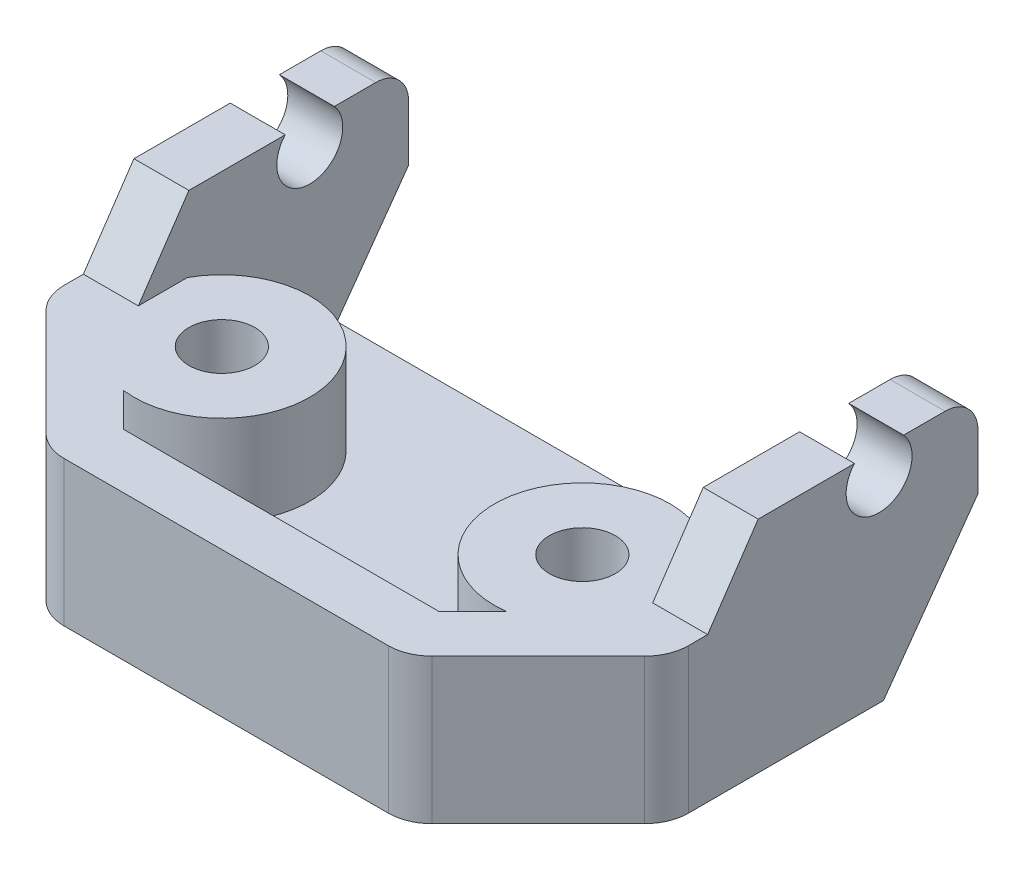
ISO-10303-21;
HEADER;
FILE_DESCRIPTION(('STEP AP214'),'2;1');
FILE_NAME('part.step','',(''),(''),'','','');
FILE_SCHEMA(('AUTOMOTIVE_DESIGN { 1 0 10303 214 1 1 1 1 }'));
ENDSEC;
DATA;
#1=APPLICATION_CONTEXT('core data for automotive mechanical design processes');
#2=APPLICATION_PROTOCOL_DEFINITION('international standard','automotive_design',2000,#1);
#3=PRODUCT_CONTEXT('',#1,'mechanical');
#4=PRODUCT('Part','Part','',(#3));
#5=PRODUCT_RELATED_PRODUCT_CATEGORY('part','',(#4));
#6=PRODUCT_DEFINITION_FORMATION('','',#4);
#7=PRODUCT_DEFINITION_CONTEXT('part definition',#1,'design');
#8=PRODUCT_DEFINITION('design','',#6,#7);
#9=PRODUCT_DEFINITION_SHAPE('','',#8);
#10=(LENGTH_UNIT() NAMED_UNIT(*) SI_UNIT(.MILLI.,.METRE.));
#11=(NAMED_UNIT(*) PLANE_ANGLE_UNIT() SI_UNIT($,.RADIAN.));
#12=(NAMED_UNIT(*) SI_UNIT($,.STERADIAN.) SOLID_ANGLE_UNIT());
#13=UNCERTAINTY_MEASURE_WITH_UNIT(LENGTH_MEASURE(1.E-05),#10,'distance_accuracy_value','');
#14=(GEOMETRIC_REPRESENTATION_CONTEXT(3) GLOBAL_UNCERTAINTY_ASSIGNED_CONTEXT((#13)) GLOBAL_UNIT_ASSIGNED_CONTEXT((#10,
#11,#12)) REPRESENTATION_CONTEXT('',''));
#15=CARTESIAN_POINT('',(0.,0.,0.));
#16=DIRECTION('',(0.,0.,1.));
#17=DIRECTION('',(1.,0.,0.));
#18=AXIS2_PLACEMENT_3D('',#15,#16,#17);
#19=CARTESIAN_POINT('',(0.,10.,-20.));
#20=DIRECTION('',(0.,-1.,0.));
#21=DIRECTION('',(0.,0.,-1.));
#22=AXIS2_PLACEMENT_3D('',#19,#20,#21);
#23=PLANE('',#22);
#24=DIRECTION('',(0.,0.,1.));
#25=VECTOR('',#24,1.);
#26=CARTESIAN_POINT('',(0.,10.,0.));
#27=LINE('',#26,#25);
#28=CARTESIAN_POINT('',(0.,10.,-14.3819660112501));
#29=VERTEX_POINT('',#28);
#30=CARTESIAN_POINT('',(0.,10.,-10.));
#31=VERTEX_POINT('',#30);
#32=EDGE_CURVE('E280',#29,#31,#27,.T.);
#33=ORIENTED_EDGE('',*,*,#32,.T.);
#34=DIRECTION('',(1.,0.,0.));
#35=VECTOR('',#34,1.);
#36=CARTESIAN_POINT('',(0.,10.,-10.));
#37=LINE('',#36,#35);
#38=CARTESIAN_POINT('',(2.5,10.,-10.));
#39=VERTEX_POINT('',#38);
#40=EDGE_CURVE('E238',#31,#39,#37,.T.);
#41=ORIENTED_EDGE('',*,*,#40,.T.);
#42=DIRECTION('',(0.,0.,1.));
#43=VECTOR('',#42,1.);
#44=CARTESIAN_POINT('',(2.5,10.,-20.));
#45=LINE('',#44,#43);
#46=CARTESIAN_POINT('',(2.5,10.,-14.3819660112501));
#47=VERTEX_POINT('',#46);
#48=EDGE_CURVE('E356',#47,#39,#45,.T.);
#49=ORIENTED_EDGE('',*,*,#48,.F.);
#50=DIRECTION('',(1.,0.,0.));
#51=VECTOR('',#50,1.);
#52=CARTESIAN_POINT('',(0.,10.,-14.3819660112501));
#53=LINE('',#52,#51);
#54=EDGE_CURVE('E415',#47,#29,#53,.F.);
#55=ORIENTED_EDGE('',*,*,#54,.T.);
#56=EDGE_LOOP('',(#33,#41,#49,#55));
#57=FACE_BOUND('',#56,.T.);
#58=ADVANCED_FACE('F26',(#57),#23,.F.);
#59=DIRECTION('',(0.,0.,-1.));
#60=VECTOR('',#59,1.);
#61=CARTESIAN_POINT('',(28.4,10.,0.));
#62=LINE('',#61,#60);
#63=CARTESIAN_POINT('',(28.4,10.,-16.6180339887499));
#64=VERTEX_POINT('',#63);
#65=CARTESIAN_POINT('',(28.4,10.,-18.5));
#66=VERTEX_POINT('',#65);
#67=EDGE_CURVE('E283',#64,#66,#62,.T.);
#68=ORIENTED_EDGE('',*,*,#67,.T.);
#69=DIRECTION('',(-1.,0.,0.));
#70=VECTOR('',#69,1.);
#71=CARTESIAN_POINT('',(0.,10.,-18.5));
#72=LINE('',#71,#70);
#73=CARTESIAN_POINT('',(25.9,10.,-18.5));
#74=VERTEX_POINT('',#73);
#75=EDGE_CURVE('E339',#66,#74,#72,.T.);
#76=ORIENTED_EDGE('',*,*,#75,.T.);
#77=DIRECTION('',(0.,0.,-1.));
#78=VECTOR('',#77,1.);
#79=CARTESIAN_POINT('',(25.9,10.,-20.));
#80=LINE('',#79,#78);
#81=CARTESIAN_POINT('',(25.9,10.,-16.6180339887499));
#82=VERTEX_POINT('',#81);
#83=EDGE_CURVE('E348',#82,#74,#80,.T.);
#84=ORIENTED_EDGE('',*,*,#83,.F.);
#85=DIRECTION('',(1.,0.,0.));
#86=VECTOR('',#85,1.);
#87=CARTESIAN_POINT('',(0.,10.,-16.6180339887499));
#88=LINE('',#87,#86);
#89=EDGE_CURVE('E416',#82,#64,#88,.T.);
#90=ORIENTED_EDGE('',*,*,#89,.T.);
#91=EDGE_LOOP('',(#68,#76,#84,#90));
#92=FACE_BOUND('',#91,.T.);
#93=ADVANCED_FACE('F346',(#92),#23,.F.);
#94=CARTESIAN_POINT('',(2.5,10.,-18.5));
#95=VERTEX_POINT('',#94);
#96=CARTESIAN_POINT('',(2.5,10.,-16.6180339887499));
#97=VERTEX_POINT('',#96);
#98=EDGE_CURVE('E354',#95,#97,#45,.T.);
#99=ORIENTED_EDGE('',*,*,#98,.F.);
#100=DIRECTION('',(-1.,0.,0.));
#101=VECTOR('',#100,1.);
#102=CARTESIAN_POINT('',(0.,10.,-18.5));
#103=LINE('',#102,#101);
#104=CARTESIAN_POINT('',(0.,10.,-18.5));
#105=VERTEX_POINT('',#104);
#106=EDGE_CURVE('E330',#95,#105,#103,.T.);
#107=ORIENTED_EDGE('',*,*,#106,.T.);
#108=CARTESIAN_POINT('',(0.,10.,-16.6180339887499));
#109=VERTEX_POINT('',#108);
#110=EDGE_CURVE('E281',#105,#109,#27,.T.);
#111=ORIENTED_EDGE('',*,*,#110,.T.);
#112=EDGE_CURVE('E411',#109,#97,#88,.T.);
#113=ORIENTED_EDGE('',*,*,#112,.T.);
#114=EDGE_LOOP('',(#99,#107,#111,#113));
#115=FACE_BOUND('',#114,.T.);
#116=ADVANCED_FACE('F558',(#115),#23,.F.);
#117=CARTESIAN_POINT('',(0.,10.,-20.));
#118=DIRECTION('',(0.,0.,1.));
#119=DIRECTION('',(1.,0.,0.));
#120=AXIS2_PLACEMENT_3D('',#117,#118,#119);
#121=PLANE('',#120);
#122=DIRECTION('',(0.,1.,0.));
#123=VECTOR('',#122,1.);
#124=CARTESIAN_POINT('',(25.9,10.,-20.));
#125=LINE('',#124,#123);
#126=CARTESIAN_POINT('',(25.9,6.,-20.));
#127=VERTEX_POINT('',#126);
#128=CARTESIAN_POINT('',(25.9,8.5,-20.));
#129=VERTEX_POINT('',#128);
#130=EDGE_CURVE('E397',#127,#129,#125,.T.);
#131=ORIENTED_EDGE('',*,*,#130,.T.);
#132=DIRECTION('',(-1.,0.,0.));
#133=VECTOR('',#132,1.);
#134=CARTESIAN_POINT('',(0.,8.5,-20.));
#135=LINE('',#134,#133);
#136=CARTESIAN_POINT('',(28.4,8.5,-20.));
#137=VERTEX_POINT('',#136);
#138=EDGE_CURVE('E34',#129,#137,#135,.F.);
#139=ORIENTED_EDGE('',*,*,#138,.T.);
#140=DIRECTION('',(0.,-1.,0.));
#141=VECTOR('',#140,1.);
#142=CARTESIAN_POINT('',(28.4,10.,-20.));
#143=LINE('',#142,#141);
#144=CARTESIAN_POINT('',(28.4,6.,-20.));
#145=VERTEX_POINT('',#144);
#146=EDGE_CURVE('E288',#137,#145,#143,.T.);
#147=ORIENTED_EDGE('',*,*,#146,.T.);
#148=DIRECTION('',(1.,0.,0.));
#149=VECTOR('',#148,1.);
#150=CARTESIAN_POINT('',(0.,6.,-20.));
#151=LINE('',#150,#149);
#152=EDGE_CURVE('E388',#127,#145,#151,.T.);
#153=ORIENTED_EDGE('',*,*,#152,.F.);
#154=EDGE_LOOP('',(#131,#139,#147,#153));
#155=FACE_BOUND('',#154,.T.);
#156=ADVANCED_FACE('F567',(#155),#121,.F.);
#157=CARTESIAN_POINT('',(0.,0.,-15.7));
#158=DIRECTION('',(0.,0.582518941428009,0.812817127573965));
#159=DIRECTION('',(0.,-0.812817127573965,0.582518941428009));
#160=AXIS2_PLACEMENT_3D('',#157,#158,#159);
#161=PLANE('',#160);
#162=DIRECTION('',(1.,0.,0.));
#163=VECTOR('',#162,1.);
#164=CARTESIAN_POINT('',(0.,0.,-15.7));
#165=LINE('',#164,#163);
#166=CARTESIAN_POINT('',(25.9,0.,-15.7));
#167=VERTEX_POINT('',#166);
#168=CARTESIAN_POINT('',(28.4,0.,-15.7));
#169=VERTEX_POINT('',#168);
#170=EDGE_CURVE('E387',#167,#169,#165,.T.);
#171=ORIENTED_EDGE('',*,*,#170,.F.);
#172=DIRECTION('',(0.,0.812817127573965,-0.582518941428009));
#173=VECTOR('',#172,1.);
#174=CARTESIAN_POINT('',(25.9,-0.826940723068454,-15.1073591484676));
#175=LINE('',#174,#173);
#176=EDGE_CURVE('E381',#167,#127,#175,.T.);
#177=ORIENTED_EDGE('',*,*,#176,.T.);
#178=ORIENTED_EDGE('',*,*,#152,.T.);
#179=DIRECTION('',(0.,-0.812817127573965,0.582518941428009));
#180=VECTOR('',#179,1.);
#181=CARTESIAN_POINT('',(28.4,0.,-15.7));
#182=LINE('',#181,#180);
#183=EDGE_CURVE('E394',#145,#169,#182,.T.);
#184=ORIENTED_EDGE('',*,*,#183,.T.);
#185=EDGE_LOOP('',(#171,#177,#178,#184));
#186=FACE_BOUND('',#185,.T.);
#187=ADVANCED_FACE('F561',(#186),#161,.F.);
#188=CARTESIAN_POINT('',(25.9,10.,-10.));
#189=VERTEX_POINT('',#188);
#190=CARTESIAN_POINT('',(25.9,10.,-14.3819660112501));
#191=VERTEX_POINT('',#190);
#192=EDGE_CURVE('E353',#189,#191,#80,.T.);
#193=ORIENTED_EDGE('',*,*,#192,.F.);
#194=CARTESIAN_POINT('',(28.4,10.,-10.));
#195=VERTEX_POINT('',#194);
#196=EDGE_CURVE('E462',#189,#195,#37,.T.);
#197=ORIENTED_EDGE('',*,*,#196,.T.);
#198=CARTESIAN_POINT('',(28.4,10.,-14.3819660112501));
#199=VERTEX_POINT('',#198);
#200=EDGE_CURVE('E284',#195,#199,#62,.T.);
#201=ORIENTED_EDGE('',*,*,#200,.T.);
#202=EDGE_CURVE('E418',#199,#191,#53,.F.);
#203=ORIENTED_EDGE('',*,*,#202,.T.);
#204=EDGE_LOOP('',(#193,#197,#201,#203));
#205=FACE_BOUND('',#204,.T.);
#206=ADVANCED_FACE('F536',(#205),#23,.F.);
#207=CARTESIAN_POINT('',(0.,0.,-20.));
#208=DIRECTION('',(0.,-1.,0.));
#209=DIRECTION('',(0.,0.,-1.));
#210=AXIS2_PLACEMENT_3D('',#207,#208,#209);
#211=PLANE('',#210);
#212=CARTESIAN_POINT('',(0.,0.,-15.7));
#213=VERTEX_POINT('',#212);
#214=CARTESIAN_POINT('',(2.5,0.,-15.7));
#215=VERTEX_POINT('',#214);
#216=EDGE_CURVE('E383',#213,#215,#165,.T.);
#217=ORIENTED_EDGE('',*,*,#216,.T.);
#218=DIRECTION('',(1.,0.,0.));
#219=VECTOR('',#218,1.);
#220=CARTESIAN_POINT('',(25.9,0.,-15.7));
#221=LINE('',#220,#219);
#222=EDGE_CURVE('E407',#215,#167,#221,.T.);
#223=ORIENTED_EDGE('',*,*,#222,.T.);
#224=ORIENTED_EDGE('',*,*,#170,.T.);
#225=DIRECTION('',(0.,0.,-1.));
#226=VECTOR('',#225,1.);
#227=CARTESIAN_POINT('',(28.4,0.,0.));
#228=LINE('',#227,#226);
#229=CARTESIAN_POINT('',(28.4,0.,-6.82842712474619));
#230=VERTEX_POINT('',#229);
#231=EDGE_CURVE('E277',#230,#169,#228,.T.);
#232=ORIENTED_EDGE('',*,*,#231,.F.);
#233=CARTESIAN_POINT('',(26.4,0.,-6.82842712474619));
#234=DIRECTION('',(0.,-1.,0.));
#235=DIRECTION('',(0.,0.,-1.));
#236=AXIS2_PLACEMENT_3D('',#233,#234,#235);
#237=CIRCLE('',#236,2.);
#238=CARTESIAN_POINT('',(27.8142135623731,0.,-5.41421356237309));
#239=VERTEX_POINT('',#238);
#240=EDGE_CURVE('E305',#230,#239,#237,.T.);
#241=ORIENTED_EDGE('',*,*,#240,.T.);
#242=DIRECTION('',(0.707106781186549,0.,-0.707106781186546));
#243=VECTOR('',#242,1.);
#244=CARTESIAN_POINT('',(21.2,0.,1.20000000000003));
#245=LINE('',#244,#243);
#246=CARTESIAN_POINT('',(22.9857864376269,0.,-0.585786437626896));
#247=VERTEX_POINT('',#246);
#248=EDGE_CURVE('E290',#239,#247,#245,.F.);
#249=ORIENTED_EDGE('',*,*,#248,.T.);
#250=CARTESIAN_POINT('',(21.5715728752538,0.,-2.));
#251=DIRECTION('',(0.,-1.,0.));
#252=DIRECTION('',(0.,0.,-1.));
#253=AXIS2_PLACEMENT_3D('',#250,#251,#252);
#254=CIRCLE('',#253,2.);
#255=CARTESIAN_POINT('',(21.5715728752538,0.,0.));
#256=VERTEX_POINT('',#255);
#257=EDGE_CURVE('E303',#247,#256,#254,.T.);
#258=ORIENTED_EDGE('',*,*,#257,.T.);
#259=DIRECTION('',(1.,0.,0.));
#260=VECTOR('',#259,1.);
#261=CARTESIAN_POINT('',(0.,0.,0.));
#262=LINE('',#261,#260);
#263=CARTESIAN_POINT('',(6.82842712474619,0.,0.));
#264=VERTEX_POINT('',#263);
#265=EDGE_CURVE('E274',#264,#256,#262,.T.);
#266=ORIENTED_EDGE('',*,*,#265,.F.);
#267=CARTESIAN_POINT('',(6.82842712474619,0.,-2.));
#268=DIRECTION('',(0.,-1.,0.));
#269=DIRECTION('',(0.,0.,-1.));
#270=AXIS2_PLACEMENT_3D('',#267,#268,#269);
#271=CIRCLE('',#270,2.);
#272=CARTESIAN_POINT('',(5.41421356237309,0.,-0.585786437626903));
#273=VERTEX_POINT('',#272);
#274=EDGE_CURVE('E298',#264,#273,#271,.T.);
#275=ORIENTED_EDGE('',*,*,#274,.T.);
#276=DIRECTION('',(0.707106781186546,0.,0.707106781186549));
#277=VECTOR('',#276,1.);
#278=CARTESIAN_POINT('',(-6.99999999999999,0.,-13.));
#279=LINE('',#278,#277);
#280=CARTESIAN_POINT('',(0.585786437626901,0.,-5.41421356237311));
#281=VERTEX_POINT('',#280);
#282=EDGE_CURVE('E293',#273,#281,#279,.F.);
#283=ORIENTED_EDGE('',*,*,#282,.T.);
#284=CARTESIAN_POINT('',(2.,0.,-6.82842712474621));
#285=DIRECTION('',(0.,-1.,0.));
#286=DIRECTION('',(0.,0.,-1.));
#287=AXIS2_PLACEMENT_3D('',#284,#285,#286);
#288=CIRCLE('',#287,2.);
#289=CARTESIAN_POINT('',(0.,0.,-6.82842712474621));
#290=VERTEX_POINT('',#289);
#291=EDGE_CURVE('E300',#281,#290,#288,.T.);
#292=ORIENTED_EDGE('',*,*,#291,.T.);
#293=DIRECTION('',(0.,0.,1.));
#294=VECTOR('',#293,1.);
#295=CARTESIAN_POINT('',(0.,0.,0.));
#296=LINE('',#295,#294);
#297=EDGE_CURVE('E272',#213,#290,#296,.T.);
#298=ORIENTED_EDGE('',*,*,#297,.F.);
#299=EDGE_LOOP('',(#217,#223,#224,#232,#241,#249,#258,#266,#275,#283,#292,#298));
#300=FACE_BOUND('',#299,.T.);
#301=CARTESIAN_POINT('',(22.4,0.,-8.));
#302=DIRECTION('',(0.,1.,0.));
#303=DIRECTION('',(0.,0.,1.));
#304=AXIS2_PLACEMENT_3D('',#301,#302,#303);
#305=CIRCLE('',#304,1.5);
#306=CARTESIAN_POINT('',(22.4,0.,-6.5));
#307=VERTEX_POINT('',#306);
#308=EDGE_CURVE('E269',#307,#307,#305,.T.);
#309=ORIENTED_EDGE('',*,*,#308,.T.);
#310=EDGE_LOOP('',(#309));
#311=FACE_BOUND('',#310,.T.);
#312=CARTESIAN_POINT('',(6.,0.,-8.));
#313=DIRECTION('',(0.,1.,0.));
#314=DIRECTION('',(0.,0.,-1.));
#315=AXIS2_PLACEMENT_3D('',#312,#313,#314);
#316=CIRCLE('',#315,1.5);
#317=CARTESIAN_POINT('',(6.,0.,-9.5));
#318=VERTEX_POINT('',#317);
#319=EDGE_CURVE('E266',#318,#318,#316,.T.);
#320=ORIENTED_EDGE('',*,*,#319,.T.);
#321=EDGE_LOOP('',(#320));
#322=FACE_BOUND('',#321,.T.);
#323=ADVANCED_FACE('F497',(#300,#311,#322),#211,.T.);
#324=CARTESIAN_POINT('',(0.,10.,0.));
#325=DIRECTION('',(1.,0.,0.));
#326=DIRECTION('',(0.,0.,-1.));
#327=AXIS2_PLACEMENT_3D('',#324,#325,#326);
#328=PLANE('',#327);
#329=ORIENTED_EDGE('',*,*,#110,.F.);
#330=CARTESIAN_POINT('',(0.,8.5,-18.5));
#331=DIRECTION('',(1.,0.,0.));
#332=DIRECTION('',(0.,0.,-1.));
#333=AXIS2_PLACEMENT_3D('',#330,#331,#332);
#334=CIRCLE('',#333,1.5);
#335=CARTESIAN_POINT('',(0.,8.5,-20.));
#336=VERTEX_POINT('',#335);
#337=EDGE_CURVE('E333',#105,#336,#334,.F.);
#338=ORIENTED_EDGE('',*,*,#337,.T.);
#339=DIRECTION('',(0.,-1.,0.));
#340=VECTOR('',#339,1.);
#341=CARTESIAN_POINT('',(0.,10.,-20.));
#342=LINE('',#341,#340);
#343=CARTESIAN_POINT('',(0.,6.,-20.));
#344=VERTEX_POINT('',#343);
#345=EDGE_CURVE('E286',#336,#344,#342,.T.);
#346=ORIENTED_EDGE('',*,*,#345,.T.);
#347=DIRECTION('',(0.,-0.812817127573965,0.582518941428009));
#348=VECTOR('',#347,1.);
#349=CARTESIAN_POINT('',(0.,0.,-15.7));
#350=LINE('',#349,#348);
#351=EDGE_CURVE('E391',#344,#213,#350,.T.);
#352=ORIENTED_EDGE('',*,*,#351,.T.);
#353=ORIENTED_EDGE('',*,*,#297,.T.);
#354=DIRECTION('',(0.,-1.,0.));
#355=VECTOR('',#354,1.);
#356=CARTESIAN_POINT('',(0.,10.,-6.82842712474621));
#357=LINE('',#356,#355);
#358=CARTESIAN_POINT('',(0.,6.6,-6.82842712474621));
#359=VERTEX_POINT('',#358);
#360=EDGE_CURVE('E317',#290,#359,#357,.F.);
#361=ORIENTED_EDGE('',*,*,#360,.T.);
#362=DIRECTION('',(0.,0.,-1.));
#363=VECTOR('',#362,1.);
#364=CARTESIAN_POINT('',(0.,6.6,-7.7));
#365=LINE('',#364,#363);
#366=CARTESIAN_POINT('',(0.,6.6,-7.7));
#367=VERTEX_POINT('',#366);
#368=EDGE_CURVE('E468',#359,#367,#365,.T.);
#369=ORIENTED_EDGE('',*,*,#368,.T.);
#370=DIRECTION('',(0.,0.828283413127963,-0.56030936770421));
#371=VECTOR('',#370,1.);
#372=CARTESIAN_POINT('',(0.,10.,-10.));
#373=LINE('',#372,#371);
#374=EDGE_CURVE('E465',#367,#31,#373,.T.);
#375=ORIENTED_EDGE('',*,*,#374,.T.);
#376=ORIENTED_EDGE('',*,*,#32,.F.);
#377=CARTESIAN_POINT('',(0.,9.,-15.5));
#378=DIRECTION('',(1.,0.,0.));
#379=DIRECTION('',(0.,0.,-1.));
#380=AXIS2_PLACEMENT_3D('',#377,#378,#379);
#381=CIRCLE('',#380,1.5);
#382=EDGE_CURVE('E421',#29,#109,#381,.T.);
#383=ORIENTED_EDGE('',*,*,#382,.T.);
#384=EDGE_LOOP('',(#329,#338,#346,#352,#353,#361,#369,#375,#376,#383));
#385=FACE_BOUND('',#384,.T.);
#386=ADVANCED_FACE('F28',(#385),#328,.F.);
#387=CARTESIAN_POINT('',(0.,10.,0.));
#388=DIRECTION('',(0.,0.,-1.));
#389=DIRECTION('',(-1.,0.,0.));
#390=AXIS2_PLACEMENT_3D('',#387,#388,#389);
#391=PLANE('',#390);
#392=DIRECTION('',(0.,-1.,0.));
#393=VECTOR('',#392,1.);
#394=CARTESIAN_POINT('',(21.5715728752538,10.,0.));
#395=LINE('',#394,#393);
#396=CARTESIAN_POINT('',(21.5715728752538,6.6,0.));
#397=VERTEX_POINT('',#396);
#398=EDGE_CURVE('E314',#256,#397,#395,.F.);
#399=ORIENTED_EDGE('',*,*,#398,.T.);
#400=DIRECTION('',(-1.,0.,0.));
#401=VECTOR('',#400,1.);
#402=CARTESIAN_POINT('',(0.,6.6,0.));
#403=LINE('',#402,#401);
#404=CARTESIAN_POINT('',(6.82842712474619,6.6,0.));
#405=VERTEX_POINT('',#404);
#406=EDGE_CURVE('E445',#397,#405,#403,.T.);
#407=ORIENTED_EDGE('',*,*,#406,.T.);
#408=DIRECTION('',(0.,1.,0.));
#409=VECTOR('',#408,1.);
#410=CARTESIAN_POINT('',(6.82842712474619,0.,0.));
#411=LINE('',#410,#409);
#412=EDGE_CURVE('E312',#405,#264,#411,.F.);
#413=ORIENTED_EDGE('',*,*,#412,.T.);
#414=ORIENTED_EDGE('',*,*,#265,.T.);
#415=EDGE_LOOP('',(#399,#407,#413,#414));
#416=FACE_BOUND('',#415,.T.);
#417=ADVANCED_FACE('F508',(#416),#391,.F.);
#418=CARTESIAN_POINT('',(28.4,10.,0.));
#419=DIRECTION('',(-1.,0.,0.));
#420=DIRECTION('',(0.,0.,1.));
#421=AXIS2_PLACEMENT_3D('',#418,#419,#420);
#422=PLANE('',#421);
#423=ORIENTED_EDGE('',*,*,#146,.F.);
#424=CARTESIAN_POINT('',(28.4,8.5,-18.5));
#425=DIRECTION('',(-1.,0.,0.));
#426=DIRECTION('',(0.,0.,1.));
#427=AXIS2_PLACEMENT_3D('',#424,#425,#426);
#428=CIRCLE('',#427,1.5);
#429=EDGE_CURVE('E11',#137,#66,#428,.F.);
#430=ORIENTED_EDGE('',*,*,#429,.T.);
#431=ORIENTED_EDGE('',*,*,#67,.F.);
#432=CARTESIAN_POINT('',(28.4,9.,-15.5));
#433=DIRECTION('',(1.,0.,0.));
#434=DIRECTION('',(0.,0.,-1.));
#435=AXIS2_PLACEMENT_3D('',#432,#433,#434);
#436=CIRCLE('',#435,1.5);
#437=EDGE_CURVE('E424',#199,#64,#436,.T.);
#438=ORIENTED_EDGE('',*,*,#437,.F.);
#439=ORIENTED_EDGE('',*,*,#200,.F.);
#440=DIRECTION('',(0.,0.828283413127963,-0.56030936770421));
#441=VECTOR('',#440,1.);
#442=CARTESIAN_POINT('',(28.4,10.,-10.));
#443=LINE('',#442,#441);
#444=CARTESIAN_POINT('',(28.4,6.6,-7.7));
#445=VERTEX_POINT('',#444);
#446=EDGE_CURVE('E471',#445,#195,#443,.T.);
#447=ORIENTED_EDGE('',*,*,#446,.F.);
#448=DIRECTION('',(0.,0.,-1.));
#449=VECTOR('',#448,1.);
#450=CARTESIAN_POINT('',(28.4,6.6,-7.7));
#451=LINE('',#450,#449);
#452=CARTESIAN_POINT('',(28.4,6.6,-6.82842712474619));
#453=VERTEX_POINT('',#452);
#454=EDGE_CURVE('E248',#453,#445,#451,.T.);
#455=ORIENTED_EDGE('',*,*,#454,.F.);
#456=DIRECTION('',(0.,1.,0.));
#457=VECTOR('',#456,1.);
#458=CARTESIAN_POINT('',(28.4,0.,-6.82842712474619));
#459=LINE('',#458,#457);
#460=EDGE_CURVE('E296',#453,#230,#459,.F.);
#461=ORIENTED_EDGE('',*,*,#460,.T.);
#462=ORIENTED_EDGE('',*,*,#231,.T.);
#463=ORIENTED_EDGE('',*,*,#183,.F.);
#464=EDGE_LOOP('',(#423,#430,#431,#438,#439,#447,#455,#461,#462,#463));
#465=FACE_BOUND('',#464,.T.);
#466=ADVANCED_FACE('F528',(#465),#422,.F.);
#467=ORIENTED_EDGE('',*,*,#345,.F.);
#468=DIRECTION('',(-1.,0.,0.));
#469=VECTOR('',#468,1.);
#470=CARTESIAN_POINT('',(0.,8.5,-20.));
#471=LINE('',#470,#469);
#472=CARTESIAN_POINT('',(2.5,8.5,-20.));
#473=VERTEX_POINT('',#472);
#474=EDGE_CURVE('E335',#336,#473,#471,.F.);
#475=ORIENTED_EDGE('',*,*,#474,.T.);
#476=DIRECTION('',(0.,-1.,0.));
#477=VECTOR('',#476,1.);
#478=CARTESIAN_POINT('',(2.5,10.,-20.));
#479=LINE('',#478,#477);
#480=CARTESIAN_POINT('',(2.5,6.,-20.));
#481=VERTEX_POINT('',#480);
#482=EDGE_CURVE('E402',#473,#481,#479,.T.);
#483=ORIENTED_EDGE('',*,*,#482,.T.);
#484=EDGE_CURVE('E384',#344,#481,#151,.T.);
#485=ORIENTED_EDGE('',*,*,#484,.F.);
#486=EDGE_LOOP('',(#467,#475,#483,#485));
#487=FACE_BOUND('',#486,.T.);
#488=ADVANCED_FACE('F576',(#487),#121,.F.);
#489=CARTESIAN_POINT('',(22.4,10.,-8.));
#490=DIRECTION('',(0.,-1.,0.));
#491=DIRECTION('',(0.,0.,-1.));
#492=AXIS2_PLACEMENT_3D('',#489,#490,#491);
#493=CYLINDRICAL_SURFACE('',#492,1.5);
#494=CARTESIAN_POINT('',(22.4,6.6,-8.));
#495=DIRECTION('',(0.,-1.,0.));
#496=DIRECTION('',(0.,0.,-1.));
#497=AXIS2_PLACEMENT_3D('',#494,#495,#496);
#498=CIRCLE('',#497,1.5);
#499=CARTESIAN_POINT('',(22.4,6.6,-9.5));
#500=VERTEX_POINT('',#499);
#501=EDGE_CURVE('E431',#500,#500,#498,.T.);
#502=ORIENTED_EDGE('',*,*,#501,.F.);
#503=EDGE_LOOP('',(#502));
#504=FACE_BOUND('',#503,.T.);
#505=ORIENTED_EDGE('',*,*,#308,.F.);
#506=EDGE_LOOP('',(#505));
#507=FACE_BOUND('',#506,.T.);
#508=ADVANCED_FACE('F652',(#504,#507),#493,.F.);
#509=CARTESIAN_POINT('',(6.,10.,-8.));
#510=DIRECTION('',(0.,-1.,0.));
#511=DIRECTION('',(0.,0.,-1.));
#512=AXIS2_PLACEMENT_3D('',#509,#510,#511);
#513=CYLINDRICAL_SURFACE('',#512,1.5);
#514=CARTESIAN_POINT('',(6.,6.6,-8.));
#515=DIRECTION('',(0.,-1.,0.));
#516=DIRECTION('',(0.,0.,-1.));
#517=AXIS2_PLACEMENT_3D('',#514,#515,#516);
#518=CIRCLE('',#517,1.5);
#519=CARTESIAN_POINT('',(6.,6.6,-9.5));
#520=VERTEX_POINT('',#519);
#521=EDGE_CURVE('E434',#520,#520,#518,.T.);
#522=ORIENTED_EDGE('',*,*,#521,.F.);
#523=EDGE_LOOP('',(#522));
#524=FACE_BOUND('',#523,.T.);
#525=ORIENTED_EDGE('',*,*,#319,.F.);
#526=EDGE_LOOP('',(#525));
#527=FACE_BOUND('',#526,.T.);
#528=ADVANCED_FACE('F649',(#524,#527),#513,.F.);
#529=CARTESIAN_POINT('',(6.,10.,0.));
#530=DIRECTION('',(0.707106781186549,0.,-0.707106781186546));
#531=DIRECTION('',(-0.707106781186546,0.,-0.707106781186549));
#532=AXIS2_PLACEMENT_3D('',#529,#530,#531);
#533=PLANE('',#532);
#534=DIRECTION('',(-0.707106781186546,0.,-0.707106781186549));
#535=VECTOR('',#534,1.);
#536=CARTESIAN_POINT('',(6.,6.6,0.));
#537=LINE('',#536,#535);
#538=CARTESIAN_POINT('',(0.585786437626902,6.6,-5.41421356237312));
#539=VERTEX_POINT('',#538);
#540=CARTESIAN_POINT('',(5.41421356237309,6.6,-0.585786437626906));
#541=VERTEX_POINT('',#540);
#542=EDGE_CURVE('E448',#539,#541,#537,.F.);
#543=ORIENTED_EDGE('',*,*,#542,.F.);
#544=DIRECTION('',(0.,1.,0.));
#545=VECTOR('',#544,1.);
#546=CARTESIAN_POINT('',(0.585786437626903,0.,-5.41421356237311));
#547=LINE('',#546,#545);
#548=EDGE_CURVE('E323',#539,#281,#547,.F.);
#549=ORIENTED_EDGE('',*,*,#548,.T.);
#550=ORIENTED_EDGE('',*,*,#282,.F.);
#551=DIRECTION('',(0.,-1.,0.));
#552=VECTOR('',#551,1.);
#553=CARTESIAN_POINT('',(5.41421356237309,10.,-0.585786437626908));
#554=LINE('',#553,#552);
#555=EDGE_CURVE('E320',#273,#541,#554,.F.);
#556=ORIENTED_EDGE('',*,*,#555,.T.);
#557=EDGE_LOOP('',(#543,#549,#550,#556));
#558=FACE_BOUND('',#557,.T.);
#559=ADVANCED_FACE('F494',(#558),#533,.F.);
#560=CARTESIAN_POINT('',(28.4,10.,-6.));
#561=DIRECTION('',(-0.707106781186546,0.,-0.707106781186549));
#562=DIRECTION('',(-0.707106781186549,0.,0.707106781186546));
#563=AXIS2_PLACEMENT_3D('',#560,#561,#562);
#564=PLANE('',#563);
#565=DIRECTION('',(-0.707106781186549,0.,0.707106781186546));
#566=VECTOR('',#565,1.);
#567=CARTESIAN_POINT('',(28.4,6.6,-6.));
#568=LINE('',#567,#566);
#569=CARTESIAN_POINT('',(22.9857864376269,6.6,-0.5857864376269));
#570=VERTEX_POINT('',#569);
#571=CARTESIAN_POINT('',(27.8142135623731,6.6,-5.41421356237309));
#572=VERTEX_POINT('',#571);
#573=EDGE_CURVE('E439',#570,#572,#568,.F.);
#574=ORIENTED_EDGE('',*,*,#573,.F.);
#575=DIRECTION('',(0.,1.,0.));
#576=VECTOR('',#575,1.);
#577=CARTESIAN_POINT('',(22.9857864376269,0.,-0.5857864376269));
#578=LINE('',#577,#576);
#579=EDGE_CURVE('E307',#570,#247,#578,.F.);
#580=ORIENTED_EDGE('',*,*,#579,.T.);
#581=ORIENTED_EDGE('',*,*,#248,.F.);
#582=DIRECTION('',(0.,-1.,0.));
#583=VECTOR('',#582,1.);
#584=CARTESIAN_POINT('',(27.8142135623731,10.,-5.41421356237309));
#585=LINE('',#584,#583);
#586=EDGE_CURVE('E309',#239,#572,#585,.F.);
#587=ORIENTED_EDGE('',*,*,#586,.T.);
#588=EDGE_LOOP('',(#574,#580,#581,#587));
#589=FACE_BOUND('',#588,.T.);
#590=ADVANCED_FACE('F517',(#589),#564,.F.);
#591=CARTESIAN_POINT('',(26.4,10.,-6.82842712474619));
#592=DIRECTION('',(0.,-1.,0.));
#593=DIRECTION('',(0.,0.,-1.));
#594=AXIS2_PLACEMENT_3D('',#591,#592,#593);
#595=CYLINDRICAL_SURFACE('',#594,2.);
#596=CARTESIAN_POINT('',(26.4,6.6,-6.82842712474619));
#597=DIRECTION('',(0.,-1.,0.));
#598=DIRECTION('',(0.,0.,-1.));
#599=AXIS2_PLACEMENT_3D('',#596,#597,#598);
#600=CIRCLE('',#599,2.);
#601=EDGE_CURVE('E437',#572,#453,#600,.F.);
#602=ORIENTED_EDGE('',*,*,#601,.F.);
#603=ORIENTED_EDGE('',*,*,#586,.F.);
#604=ORIENTED_EDGE('',*,*,#240,.F.);
#605=ORIENTED_EDGE('',*,*,#460,.F.);
#606=EDGE_LOOP('',(#602,#603,#604,#605));
#607=FACE_BOUND('',#606,.T.);
#608=ADVANCED_FACE('F522',(#607),#595,.T.);
#609=CARTESIAN_POINT('',(21.5715728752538,10.,-2.));
#610=DIRECTION('',(0.,1.,0.));
#611=DIRECTION('',(0.,0.,1.));
#612=AXIS2_PLACEMENT_3D('',#609,#610,#611);
#613=CYLINDRICAL_SURFACE('',#612,2.);
#614=CARTESIAN_POINT('',(21.5715728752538,6.6,-2.));
#615=DIRECTION('',(0.,-1.,0.));
#616=DIRECTION('',(0.,0.,-1.));
#617=AXIS2_PLACEMENT_3D('',#614,#615,#616);
#618=CIRCLE('',#617,2.);
#619=EDGE_CURVE('E441',#397,#570,#618,.F.);
#620=ORIENTED_EDGE('',*,*,#619,.F.);
#621=ORIENTED_EDGE('',*,*,#398,.F.);
#622=ORIENTED_EDGE('',*,*,#257,.F.);
#623=ORIENTED_EDGE('',*,*,#579,.F.);
#624=EDGE_LOOP('',(#620,#621,#622,#623));
#625=FACE_BOUND('',#624,.T.);
#626=ADVANCED_FACE('F512',(#625),#613,.T.);
#627=CARTESIAN_POINT('',(2.,10.,-6.82842712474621));
#628=DIRECTION('',(0.,1.,0.));
#629=DIRECTION('',(0.,0.,1.));
#630=AXIS2_PLACEMENT_3D('',#627,#628,#629);
#631=CYLINDRICAL_SURFACE('',#630,2.);
#632=CARTESIAN_POINT('',(2.,6.6,-6.82842712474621));
#633=DIRECTION('',(0.,-1.,0.));
#634=DIRECTION('',(0.,0.,-1.));
#635=AXIS2_PLACEMENT_3D('',#632,#633,#634);
#636=CIRCLE('',#635,2.);
#637=EDGE_CURVE('E443',#359,#539,#636,.F.);
#638=ORIENTED_EDGE('',*,*,#637,.F.);
#639=ORIENTED_EDGE('',*,*,#360,.F.);
#640=ORIENTED_EDGE('',*,*,#291,.F.);
#641=ORIENTED_EDGE('',*,*,#548,.F.);
#642=EDGE_LOOP('',(#638,#639,#640,#641));
#643=FACE_BOUND('',#642,.T.);
#644=ADVANCED_FACE('F490',(#643),#631,.T.);
#645=CARTESIAN_POINT('',(6.82842712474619,10.,-2.));
#646=DIRECTION('',(0.,-1.,0.));
#647=DIRECTION('',(0.,0.,-1.));
#648=AXIS2_PLACEMENT_3D('',#645,#646,#647);
#649=CYLINDRICAL_SURFACE('',#648,2.);
#650=CARTESIAN_POINT('',(6.82842712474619,6.6,-2.));
#651=DIRECTION('',(0.,-1.,0.));
#652=DIRECTION('',(0.,0.,-1.));
#653=AXIS2_PLACEMENT_3D('',#650,#651,#652);
#654=CIRCLE('',#653,2.);
#655=EDGE_CURVE('E450',#541,#405,#654,.F.);
#656=ORIENTED_EDGE('',*,*,#655,.F.);
#657=ORIENTED_EDGE('',*,*,#555,.F.);
#658=ORIENTED_EDGE('',*,*,#274,.F.);
#659=ORIENTED_EDGE('',*,*,#412,.F.);
#660=EDGE_LOOP('',(#656,#657,#658,#659));
#661=FACE_BOUND('',#660,.T.);
#662=ADVANCED_FACE('F505',(#661),#649,.T.);
#663=CARTESIAN_POINT('',(0.,2.5,-20.));
#664=DIRECTION('',(0.,-1.,0.));
#665=DIRECTION('',(0.,0.,-1.));
#666=AXIS2_PLACEMENT_3D('',#663,#664,#665);
#667=PLANE('',#666);
#668=DIRECTION('',(0.,0.,-1.));
#669=VECTOR('',#668,1.);
#670=CARTESIAN_POINT('',(25.9,2.5,-20.));
#671=LINE('',#670,#669);
#672=CARTESIAN_POINT('',(25.9,2.5,-9.9364916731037));
#673=VERTEX_POINT('',#672);
#674=CARTESIAN_POINT('',(25.9,2.5,-15.7));
#675=VERTEX_POINT('',#674);
#676=EDGE_CURVE('E255',#673,#675,#671,.T.);
#677=ORIENTED_EDGE('',*,*,#676,.T.);
#678=DIRECTION('',(-1.,0.,0.));
#679=VECTOR('',#678,1.);
#680=CARTESIAN_POINT('',(0.,2.5,-15.7));
#681=LINE('',#680,#679);
#682=CARTESIAN_POINT('',(2.5,2.5,-15.7));
#683=VERTEX_POINT('',#682);
#684=EDGE_CURVE('E399',#675,#683,#681,.T.);
#685=ORIENTED_EDGE('',*,*,#684,.T.);
#686=DIRECTION('',(0.,0.,1.));
#687=VECTOR('',#686,1.);
#688=CARTESIAN_POINT('',(2.5,2.5,-20.));
#689=LINE('',#688,#687);
#690=CARTESIAN_POINT('',(2.5,2.5,-9.93649167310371));
#691=VERTEX_POINT('',#690);
#692=EDGE_CURVE('E369',#683,#691,#689,.T.);
#693=ORIENTED_EDGE('',*,*,#692,.T.);
#694=CARTESIAN_POINT('',(6.,2.5,-8.));
#695=DIRECTION('',(0.,-1.,0.));
#696=DIRECTION('',(0.,0.,-1.));
#697=AXIS2_PLACEMENT_3D('',#694,#695,#696);
#698=CIRCLE('',#697,4.);
#699=CARTESIAN_POINT('',(5.50475734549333,2.5,-4.03077656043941));
#700=VERTEX_POINT('',#699);
#701=EDGE_CURVE('E364',#700,#691,#698,.F.);
#702=ORIENTED_EDGE('',*,*,#701,.F.);
#703=DIRECTION('',(0.707106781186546,0.,0.707106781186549));
#704=VECTOR('',#703,1.);
#705=CARTESIAN_POINT('',(-5.23223304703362,2.5,-14.7677669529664));
#706=LINE('',#705,#704);
#707=CARTESIAN_POINT('',(7.03553390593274,2.5,-2.5));
#708=VERTEX_POINT('',#707);
#709=EDGE_CURVE('E363',#708,#700,#706,.F.);
#710=ORIENTED_EDGE('',*,*,#709,.F.);
#711=DIRECTION('',(1.,0.,0.));
#712=VECTOR('',#711,1.);
#713=CARTESIAN_POINT('',(0.,2.5,-2.5));
#714=LINE('',#713,#712);
#715=CARTESIAN_POINT('',(21.3644660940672,2.5,-2.5));
#716=VERTEX_POINT('',#715);
#717=EDGE_CURVE('E371',#708,#716,#714,.T.);
#718=ORIENTED_EDGE('',*,*,#717,.T.);
#719=DIRECTION('',(0.707106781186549,0.,-0.707106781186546));
#720=VECTOR('',#719,1.);
#721=CARTESIAN_POINT('',(19.4322330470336,2.5,-0.567766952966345));
#722=LINE('',#721,#720);
#723=CARTESIAN_POINT('',(22.8952426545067,2.5,-4.03077656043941));
#724=VERTEX_POINT('',#723);
#725=EDGE_CURVE('E355',#724,#716,#722,.F.);
#726=ORIENTED_EDGE('',*,*,#725,.F.);
#727=CARTESIAN_POINT('',(22.4,2.5,-8.));
#728=DIRECTION('',(0.,-1.,0.));
#729=DIRECTION('',(0.,0.,-1.));
#730=AXIS2_PLACEMENT_3D('',#727,#728,#729);
#731=CIRCLE('',#730,4.);
#732=EDGE_CURVE('E367',#673,#724,#731,.F.);
#733=ORIENTED_EDGE('',*,*,#732,.F.);
#734=EDGE_LOOP('',(#677,#685,#693,#702,#710,#718,#726,#733));
#735=FACE_BOUND('',#734,.T.);
#736=ADVANCED_FACE('F600',(#735),#667,.F.);
#737=CARTESIAN_POINT('',(2.5,10.,0.));
#738=DIRECTION('',(1.,0.,0.));
#739=DIRECTION('',(0.,0.,-1.));
#740=AXIS2_PLACEMENT_3D('',#737,#738,#739);
#741=PLANE('',#740);
#742=ORIENTED_EDGE('',*,*,#482,.F.);
#743=CARTESIAN_POINT('',(2.5,8.5,-18.5));
#744=DIRECTION('',(1.,0.,0.));
#745=DIRECTION('',(0.,0.,-1.));
#746=AXIS2_PLACEMENT_3D('',#743,#744,#745);
#747=CIRCLE('',#746,1.5);
#748=EDGE_CURVE('E337',#473,#95,#747,.T.);
#749=ORIENTED_EDGE('',*,*,#748,.T.);
#750=ORIENTED_EDGE('',*,*,#98,.T.);
#751=CARTESIAN_POINT('',(2.5,9.,-15.5));
#752=DIRECTION('',(1.,0.,0.));
#753=DIRECTION('',(0.,0.,-1.));
#754=AXIS2_PLACEMENT_3D('',#751,#752,#753);
#755=CIRCLE('',#754,1.5);
#756=EDGE_CURVE('E412',#47,#97,#755,.T.);
#757=ORIENTED_EDGE('',*,*,#756,.F.);
#758=ORIENTED_EDGE('',*,*,#48,.T.);
#759=DIRECTION('',(0.,0.828283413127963,-0.56030936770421));
#760=VECTOR('',#759,1.);
#761=CARTESIAN_POINT('',(2.5,5.35905044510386,-6.86053412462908));
#762=LINE('',#761,#760);
#763=CARTESIAN_POINT('',(2.5,6.6,-7.7));
#764=VERTEX_POINT('',#763);
#765=EDGE_CURVE('E428',#764,#39,#762,.T.);
#766=ORIENTED_EDGE('',*,*,#765,.F.);
#767=DIRECTION('',(0.,0.,1.));
#768=VECTOR('',#767,1.);
#769=CARTESIAN_POINT('',(2.5,6.6,-12.190983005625));
#770=LINE('',#769,#768);
#771=CARTESIAN_POINT('',(2.5,6.6,-9.93649167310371));
#772=VERTEX_POINT('',#771);
#773=EDGE_CURVE('E249',#772,#764,#770,.T.);
#774=ORIENTED_EDGE('',*,*,#773,.F.);
#775=DIRECTION('',(0.,-1.,0.));
#776=VECTOR('',#775,1.);
#777=CARTESIAN_POINT('',(2.5,10.,-9.93649167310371));
#778=LINE('',#777,#776);
#779=EDGE_CURVE('E256',#691,#772,#778,.F.);
#780=ORIENTED_EDGE('',*,*,#779,.F.);
#781=ORIENTED_EDGE('',*,*,#692,.F.);
#782=DIRECTION('',(0.,1.,0.));
#783=VECTOR('',#782,1.);
#784=CARTESIAN_POINT('',(2.5,0.,-15.7));
#785=LINE('',#784,#783);
#786=EDGE_CURVE('E405',#215,#683,#785,.T.);
#787=ORIENTED_EDGE('',*,*,#786,.F.);
#788=DIRECTION('',(0.,-0.812817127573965,0.582518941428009));
#789=VECTOR('',#788,1.);
#790=CARTESIAN_POINT('',(2.5,-0.826940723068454,-15.1073591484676));
#791=LINE('',#790,#789);
#792=EDGE_CURVE('E368',#481,#215,#791,.T.);
#793=ORIENTED_EDGE('',*,*,#792,.F.);
#794=EDGE_LOOP('',(#742,#749,#750,#757,#758,#766,#774,#780,#781,#787,#793));
#795=FACE_BOUND('',#794,.T.);
#796=ADVANCED_FACE('F617',(#795),#741,.T.);
#797=CARTESIAN_POINT('',(0.,10.,-2.5));
#798=DIRECTION('',(0.,0.,-1.));
#799=DIRECTION('',(-1.,0.,0.));
#800=AXIS2_PLACEMENT_3D('',#797,#798,#799);
#801=PLANE('',#800);
#802=DIRECTION('',(-1.,0.,0.));
#803=VECTOR('',#802,1.);
#804=CARTESIAN_POINT('',(0.,6.6,-2.5));
#805=LINE('',#804,#803);
#806=CARTESIAN_POINT('',(21.3644660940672,6.6,-2.5));
#807=VERTEX_POINT('',#806);
#808=CARTESIAN_POINT('',(7.03553390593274,6.6,-2.5));
#809=VERTEX_POINT('',#808);
#810=EDGE_CURVE('E237',#807,#809,#805,.T.);
#811=ORIENTED_EDGE('',*,*,#810,.F.);
#812=DIRECTION('',(0.,1.,0.));
#813=VECTOR('',#812,1.);
#814=CARTESIAN_POINT('',(21.3644660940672,10.,-2.5));
#815=LINE('',#814,#813);
#816=EDGE_CURVE('E361',#807,#716,#815,.F.);
#817=ORIENTED_EDGE('',*,*,#816,.T.);
#818=ORIENTED_EDGE('',*,*,#717,.F.);
#819=DIRECTION('',(0.,-1.,0.));
#820=VECTOR('',#819,1.);
#821=CARTESIAN_POINT('',(7.03553390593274,10.,-2.5));
#822=LINE('',#821,#820);
#823=EDGE_CURVE('E261',#708,#809,#822,.F.);
#824=ORIENTED_EDGE('',*,*,#823,.T.);
#825=EDGE_LOOP('',(#811,#817,#818,#824));
#826=FACE_BOUND('',#825,.T.);
#827=ADVANCED_FACE('F609',(#826),#801,.T.);
#828=CARTESIAN_POINT('',(25.9,10.,0.));
#829=DIRECTION('',(-1.,0.,0.));
#830=DIRECTION('',(0.,0.,1.));
#831=AXIS2_PLACEMENT_3D('',#828,#829,#830);
#832=PLANE('',#831);
#833=ORIENTED_EDGE('',*,*,#83,.T.);
#834=CARTESIAN_POINT('',(25.9,8.5,-18.5));
#835=DIRECTION('',(-1.,0.,0.));
#836=DIRECTION('',(0.,0.,1.));
#837=AXIS2_PLACEMENT_3D('',#834,#835,#836);
#838=CIRCLE('',#837,1.5);
#839=EDGE_CURVE('E48',#74,#129,#838,.T.);
#840=ORIENTED_EDGE('',*,*,#839,.T.);
#841=ORIENTED_EDGE('',*,*,#130,.F.);
#842=ORIENTED_EDGE('',*,*,#176,.F.);
#843=DIRECTION('',(0.,1.,0.));
#844=VECTOR('',#843,1.);
#845=CARTESIAN_POINT('',(25.9,0.,-15.7));
#846=LINE('',#845,#844);
#847=EDGE_CURVE('E404',#167,#675,#846,.T.);
#848=ORIENTED_EDGE('',*,*,#847,.T.);
#849=ORIENTED_EDGE('',*,*,#676,.F.);
#850=DIRECTION('',(0.,-1.,0.));
#851=VECTOR('',#850,1.);
#852=CARTESIAN_POINT('',(25.9,10.,-9.9364916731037));
#853=LINE('',#852,#851);
#854=CARTESIAN_POINT('',(25.9,6.6,-9.9364916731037));
#855=VERTEX_POINT('',#854);
#856=EDGE_CURVE('E232',#673,#855,#853,.F.);
#857=ORIENTED_EDGE('',*,*,#856,.T.);
#858=DIRECTION('',(0.,0.,-1.));
#859=VECTOR('',#858,1.);
#860=CARTESIAN_POINT('',(25.9,6.6,-12.190983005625));
#861=LINE('',#860,#859);
#862=CARTESIAN_POINT('',(25.9,6.6,-7.7));
#863=VERTEX_POINT('',#862);
#864=EDGE_CURVE('E242',#863,#855,#861,.T.);
#865=ORIENTED_EDGE('',*,*,#864,.F.);
#866=DIRECTION('',(0.,-0.828283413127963,0.56030936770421));
#867=VECTOR('',#866,1.);
#868=CARTESIAN_POINT('',(25.9,5.35905044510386,-6.86053412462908));
#869=LINE('',#868,#867);
#870=EDGE_CURVE('E426',#189,#863,#869,.T.);
#871=ORIENTED_EDGE('',*,*,#870,.F.);
#872=ORIENTED_EDGE('',*,*,#192,.T.);
#873=CARTESIAN_POINT('',(25.9,9.,-15.5));
#874=DIRECTION('',(-1.,0.,0.));
#875=DIRECTION('',(0.,0.,1.));
#876=AXIS2_PLACEMENT_3D('',#873,#874,#875);
#877=CIRCLE('',#876,1.5);
#878=EDGE_CURVE('E325',#82,#191,#877,.T.);
#879=ORIENTED_EDGE('',*,*,#878,.F.);
#880=EDGE_LOOP('',(#833,#840,#841,#842,#848,#849,#857,#865,#871,#872,#879));
#881=FACE_BOUND('',#880,.T.);
#882=ADVANCED_FACE('F252',(#881),#832,.T.);
#883=CARTESIAN_POINT('',(22.4,10.,-8.));
#884=DIRECTION('',(0.,-1.,0.));
#885=DIRECTION('',(0.,0.,-1.));
#886=AXIS2_PLACEMENT_3D('',#883,#884,#885);
#887=CYLINDRICAL_SURFACE('',#886,4.);
#888=CARTESIAN_POINT('',(22.4,6.6,-8.));
#889=DIRECTION('',(0.,-1.,0.));
#890=DIRECTION('',(0.,0.,-1.));
#891=AXIS2_PLACEMENT_3D('',#888,#889,#890);
#892=CIRCLE('',#891,4.);
#893=CARTESIAN_POINT('',(22.8952426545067,6.6,-4.03077656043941));
#894=VERTEX_POINT('',#893);
#895=EDGE_CURVE('E227',#894,#855,#892,.T.);
#896=ORIENTED_EDGE('',*,*,#895,.T.);
#897=ORIENTED_EDGE('',*,*,#856,.F.);
#898=ORIENTED_EDGE('',*,*,#732,.T.);
#899=DIRECTION('',(0.,-1.,0.));
#900=VECTOR('',#899,1.);
#901=CARTESIAN_POINT('',(22.8952426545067,10.,-4.03077656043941));
#902=LINE('',#901,#900);
#903=EDGE_CURVE('E234',#894,#724,#902,.T.);
#904=ORIENTED_EDGE('',*,*,#903,.F.);
#905=EDGE_LOOP('',(#896,#897,#898,#904));
#906=FACE_BOUND('',#905,.T.);
#907=ADVANCED_FACE('F229',(#906),#887,.T.);
#908=CARTESIAN_POINT('',(6.,10.,-8.));
#909=DIRECTION('',(0.,-1.,0.));
#910=DIRECTION('',(0.,0.,-1.));
#911=AXIS2_PLACEMENT_3D('',#908,#909,#910);
#912=CYLINDRICAL_SURFACE('',#911,4.);
#913=ORIENTED_EDGE('',*,*,#779,.T.);
#914=CARTESIAN_POINT('',(6.,6.6,-8.));
#915=DIRECTION('',(0.,-1.,0.));
#916=DIRECTION('',(0.,0.,-1.));
#917=AXIS2_PLACEMENT_3D('',#914,#915,#916);
#918=CIRCLE('',#917,4.);
#919=CARTESIAN_POINT('',(5.50475734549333,6.6,-4.03077656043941));
#920=VERTEX_POINT('',#919);
#921=EDGE_CURVE('E452',#772,#920,#918,.T.);
#922=ORIENTED_EDGE('',*,*,#921,.T.);
#923=DIRECTION('',(0.,-1.,0.));
#924=VECTOR('',#923,1.);
#925=CARTESIAN_POINT('',(5.50475734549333,10.,-4.03077656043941));
#926=LINE('',#925,#924);
#927=EDGE_CURVE('E259',#920,#700,#926,.T.);
#928=ORIENTED_EDGE('',*,*,#927,.T.);
#929=ORIENTED_EDGE('',*,*,#701,.T.);
#930=EDGE_LOOP('',(#913,#922,#928,#929));
#931=FACE_BOUND('',#930,.T.);
#932=ADVANCED_FACE('F615',(#931),#912,.T.);
#933=CARTESIAN_POINT('',(7.76776695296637,10.,-1.76776695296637));
#934=DIRECTION('',(0.707106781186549,0.,-0.707106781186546));
#935=DIRECTION('',(-0.707106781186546,0.,-0.707106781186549));
#936=AXIS2_PLACEMENT_3D('',#933,#934,#935);
#937=PLANE('',#936);
#938=ORIENTED_EDGE('',*,*,#927,.F.);
#939=DIRECTION('',(-0.707106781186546,0.,-0.707106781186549));
#940=VECTOR('',#939,1.);
#941=CARTESIAN_POINT('',(7.76776695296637,6.6,-1.76776695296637));
#942=LINE('',#941,#940);
#943=EDGE_CURVE('E455',#920,#809,#942,.F.);
#944=ORIENTED_EDGE('',*,*,#943,.T.);
#945=ORIENTED_EDGE('',*,*,#823,.F.);
#946=ORIENTED_EDGE('',*,*,#709,.T.);
#947=EDGE_LOOP('',(#938,#944,#945,#946));
#948=FACE_BOUND('',#947,.T.);
#949=ADVANCED_FACE('F613',(#948),#937,.T.);
#950=CARTESIAN_POINT('',(26.6322330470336,10.,-7.76776695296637));
#951=DIRECTION('',(-0.707106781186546,0.,-0.707106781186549));
#952=DIRECTION('',(-0.707106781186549,0.,0.707106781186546));
#953=AXIS2_PLACEMENT_3D('',#950,#951,#952);
#954=PLANE('',#953);
#955=ORIENTED_EDGE('',*,*,#816,.F.);
#956=DIRECTION('',(-0.707106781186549,0.,0.707106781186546));
#957=VECTOR('',#956,1.);
#958=CARTESIAN_POINT('',(26.6322330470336,6.6,-7.76776695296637));
#959=LINE('',#958,#957);
#960=EDGE_CURVE('E328',#807,#894,#959,.F.);
#961=ORIENTED_EDGE('',*,*,#960,.T.);
#962=ORIENTED_EDGE('',*,*,#903,.T.);
#963=ORIENTED_EDGE('',*,*,#725,.T.);
#964=EDGE_LOOP('',(#955,#961,#962,#963));
#965=FACE_BOUND('',#964,.T.);
#966=ADVANCED_FACE('F606',(#965),#954,.T.);
#967=ORIENTED_EDGE('',*,*,#484,.T.);
#968=ORIENTED_EDGE('',*,*,#792,.T.);
#969=ORIENTED_EDGE('',*,*,#216,.F.);
#970=ORIENTED_EDGE('',*,*,#351,.F.);
#971=EDGE_LOOP('',(#967,#968,#969,#970));
#972=FACE_BOUND('',#971,.T.);
#973=ADVANCED_FACE('F570',(#972),#161,.F.);
#974=CARTESIAN_POINT('',(25.9,0.,-15.7));
#975=DIRECTION('',(0.,0.,1.));
#976=DIRECTION('',(1.,0.,0.));
#977=AXIS2_PLACEMENT_3D('',#974,#975,#976);
#978=PLANE('',#977);
#979=ORIENTED_EDGE('',*,*,#847,.F.);
#980=ORIENTED_EDGE('',*,*,#222,.F.);
#981=ORIENTED_EDGE('',*,*,#786,.T.);
#982=ORIENTED_EDGE('',*,*,#684,.F.);
#983=EDGE_LOOP('',(#979,#980,#981,#982));
#984=FACE_BOUND('',#983,.T.);
#985=ADVANCED_FACE('F596',(#984),#978,.F.);
#986=CARTESIAN_POINT('',(0.,9.,-15.5));
#987=DIRECTION('',(1.,0.,0.));
#988=DIRECTION('',(0.,0.,-1.));
#989=AXIS2_PLACEMENT_3D('',#986,#987,#988);
#990=CYLINDRICAL_SURFACE('',#989,1.5);
#991=ORIENTED_EDGE('',*,*,#878,.T.);
#992=ORIENTED_EDGE('',*,*,#202,.F.);
#993=ORIENTED_EDGE('',*,*,#437,.T.);
#994=ORIENTED_EDGE('',*,*,#89,.F.);
#995=EDGE_LOOP('',(#991,#992,#993,#994));
#996=FACE_BOUND('',#995,.T.);
#997=ADVANCED_FACE('F539',(#996),#990,.F.);
#998=ORIENTED_EDGE('',*,*,#382,.F.);
#999=ORIENTED_EDGE('',*,*,#54,.F.);
#1000=ORIENTED_EDGE('',*,*,#756,.T.);
#1001=ORIENTED_EDGE('',*,*,#112,.F.);
#1002=EDGE_LOOP('',(#998,#999,#1000,#1001));
#1003=FACE_BOUND('',#1002,.T.);
#1004=ADVANCED_FACE('F672',(#1003),#990,.F.);
#1005=CARTESIAN_POINT('',(0.,10.,-10.));
#1006=DIRECTION('',(0.,-0.56030936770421,-0.828283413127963));
#1007=DIRECTION('',(0.,0.828283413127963,-0.56030936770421));
#1008=AXIS2_PLACEMENT_3D('',#1005,#1006,#1007);
#1009=PLANE('',#1008);
#1010=ORIENTED_EDGE('',*,*,#870,.T.);
#1011=DIRECTION('',(1.,0.,0.));
#1012=VECTOR('',#1011,1.);
#1013=CARTESIAN_POINT('',(0.,6.6,-7.7));
#1014=LINE('',#1013,#1012);
#1015=EDGE_CURVE('E246',#863,#445,#1014,.T.);
#1016=ORIENTED_EDGE('',*,*,#1015,.T.);
#1017=ORIENTED_EDGE('',*,*,#446,.T.);
#1018=ORIENTED_EDGE('',*,*,#196,.F.);
#1019=EDGE_LOOP('',(#1010,#1016,#1017,#1018));
#1020=FACE_BOUND('',#1019,.T.);
#1021=ADVANCED_FACE('F533',(#1020),#1009,.F.);
#1022=EDGE_CURVE('E459',#367,#764,#1014,.T.);
#1023=ORIENTED_EDGE('',*,*,#1022,.T.);
#1024=ORIENTED_EDGE('',*,*,#765,.T.);
#1025=ORIENTED_EDGE('',*,*,#40,.F.);
#1026=ORIENTED_EDGE('',*,*,#374,.F.);
#1027=EDGE_LOOP('',(#1023,#1024,#1025,#1026));
#1028=FACE_BOUND('',#1027,.T.);
#1029=ADVANCED_FACE('F480',(#1028),#1009,.F.);
#1030=CARTESIAN_POINT('',(0.,6.6,-7.7));
#1031=DIRECTION('',(0.,-1.,0.));
#1032=DIRECTION('',(0.,0.,-1.));
#1033=AXIS2_PLACEMENT_3D('',#1030,#1031,#1032);
#1034=PLANE('',#1033);
#1035=ORIENTED_EDGE('',*,*,#1015,.F.);
#1036=ORIENTED_EDGE('',*,*,#864,.T.);
#1037=ORIENTED_EDGE('',*,*,#895,.F.);
#1038=ORIENTED_EDGE('',*,*,#960,.F.);
#1039=ORIENTED_EDGE('',*,*,#810,.T.);
#1040=ORIENTED_EDGE('',*,*,#943,.F.);
#1041=ORIENTED_EDGE('',*,*,#921,.F.);
#1042=ORIENTED_EDGE('',*,*,#773,.T.);
#1043=ORIENTED_EDGE('',*,*,#1022,.F.);
#1044=ORIENTED_EDGE('',*,*,#368,.F.);
#1045=ORIENTED_EDGE('',*,*,#637,.T.);
#1046=ORIENTED_EDGE('',*,*,#542,.T.);
#1047=ORIENTED_EDGE('',*,*,#655,.T.);
#1048=ORIENTED_EDGE('',*,*,#406,.F.);
#1049=ORIENTED_EDGE('',*,*,#619,.T.);
#1050=ORIENTED_EDGE('',*,*,#573,.T.);
#1051=ORIENTED_EDGE('',*,*,#601,.T.);
#1052=ORIENTED_EDGE('',*,*,#454,.T.);
#1053=EDGE_LOOP('',(#1035,#1036,#1037,#1038,#1039,#1040,#1041,#1042,#1043,#1044,#1045,#1046,
#1047,#1048,#1049,#1050,#1051,#1052));
#1054=FACE_BOUND('',#1053,.T.);
#1055=ORIENTED_EDGE('',*,*,#501,.T.);
#1056=EDGE_LOOP('',(#1055));
#1057=FACE_BOUND('',#1056,.T.);
#1058=ORIENTED_EDGE('',*,*,#521,.T.);
#1059=EDGE_LOOP('',(#1058));
#1060=FACE_BOUND('',#1059,.T.);
#1061=ADVANCED_FACE('F243',(#1054,#1057,#1060),#1034,.F.);
#1062=CARTESIAN_POINT('',(0.,8.5,-18.5));
#1063=DIRECTION('',(-1.,0.,0.));
#1064=DIRECTION('',(0.,0.,1.));
#1065=AXIS2_PLACEMENT_3D('',#1062,#1063,#1064);
#1066=CYLINDRICAL_SURFACE('',#1065,1.5);
#1067=ORIENTED_EDGE('',*,*,#748,.F.);
#1068=ORIENTED_EDGE('',*,*,#474,.F.);
#1069=ORIENTED_EDGE('',*,*,#337,.F.);
#1070=ORIENTED_EDGE('',*,*,#106,.F.);
#1071=EDGE_LOOP('',(#1067,#1068,#1069,#1070));
#1072=FACE_BOUND('',#1071,.T.);
#1073=ADVANCED_FACE('F543',(#1072),#1066,.T.);
#1074=CARTESIAN_POINT('',(0.,8.5,-18.5));
#1075=DIRECTION('',(-1.,0.,0.));
#1076=DIRECTION('',(0.,0.,1.));
#1077=AXIS2_PLACEMENT_3D('',#1074,#1075,#1076);
#1078=CYLINDRICAL_SURFACE('',#1077,1.5);
#1079=ORIENTED_EDGE('',*,*,#429,.F.);
#1080=ORIENTED_EDGE('',*,*,#138,.F.);
#1081=ORIENTED_EDGE('',*,*,#839,.F.);
#1082=ORIENTED_EDGE('',*,*,#75,.F.);
#1083=EDGE_LOOP('',(#1079,#1080,#1081,#1082));
#1084=FACE_BOUND('',#1083,.T.);
#1085=ADVANCED_FACE('F541',(#1084),#1078,.T.);
#1086=CLOSED_SHELL('',(#58,#93,#116,#156,#187,#206,#323,#386,#417,#466,#488,#508,#528,#559,#590,
#608,#626,#644,#662,#736,#796,#827,#882,#907,#932,#949,#966,#973,#985,#997,#1004,#1021,#1029,
#1061,#1073,#1085));
#1087=MANIFOLD_SOLID_BREP('B2',#1086);
#1088=ADVANCED_BREP_SHAPE_REPRESENTATION('',(#18,#1087),#14);
#1089=SHAPE_DEFINITION_REPRESENTATION(#9,#1088);
ENDSEC;
END-ISO-10303-21;
